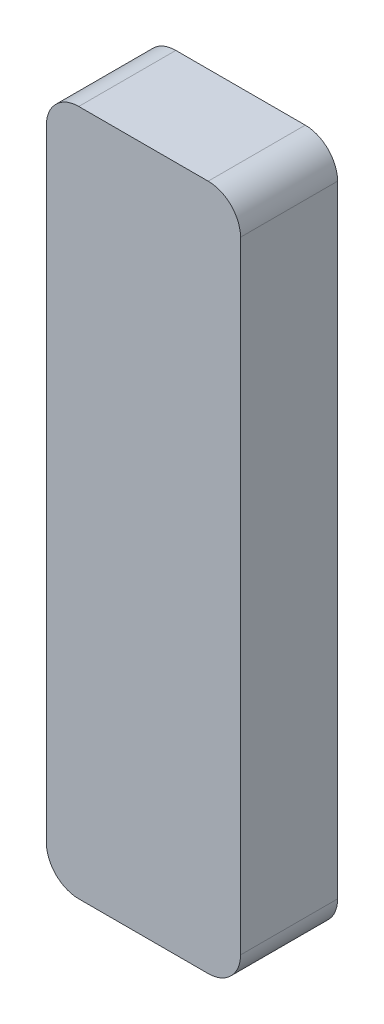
ISO-10303-21;
HEADER;
FILE_DESCRIPTION(('STEP AP214'),'2;1');
FILE_NAME('part.step','',(''),(''),'','','');
FILE_SCHEMA(('AUTOMOTIVE_DESIGN { 1 0 10303 214 1 1 1 1 }'));
ENDSEC;
DATA;
#1=APPLICATION_CONTEXT('core data for automotive mechanical design processes');
#2=APPLICATION_PROTOCOL_DEFINITION('international standard','automotive_design',2000,#1);
#3=PRODUCT_CONTEXT('',#1,'mechanical');
#4=PRODUCT('Part','Part','',(#3));
#5=PRODUCT_RELATED_PRODUCT_CATEGORY('part','',(#4));
#6=PRODUCT_DEFINITION_FORMATION('','',#4);
#7=PRODUCT_DEFINITION_CONTEXT('part definition',#1,'design');
#8=PRODUCT_DEFINITION('design','',#6,#7);
#9=PRODUCT_DEFINITION_SHAPE('','',#8);
#10=(LENGTH_UNIT() NAMED_UNIT(*) SI_UNIT(.MILLI.,.METRE.));
#11=(NAMED_UNIT(*) PLANE_ANGLE_UNIT() SI_UNIT($,.RADIAN.));
#12=(NAMED_UNIT(*) SI_UNIT($,.STERADIAN.) SOLID_ANGLE_UNIT());
#13=UNCERTAINTY_MEASURE_WITH_UNIT(LENGTH_MEASURE(1.E-05),#10,'distance_accuracy_value','');
#14=(GEOMETRIC_REPRESENTATION_CONTEXT(3) GLOBAL_UNCERTAINTY_ASSIGNED_CONTEXT((#13)) GLOBAL_UNIT_ASSIGNED_CONTEXT((#10,
#11,#12)) REPRESENTATION_CONTEXT('',''));
#15=CARTESIAN_POINT('',(0.,0.,0.));
#16=DIRECTION('',(0.,0.,1.));
#17=DIRECTION('',(1.,0.,0.));
#18=AXIS2_PLACEMENT_3D('',#15,#16,#17);
#19=CARTESIAN_POINT('',(-2.,-9.605,3.));
#20=DIRECTION('',(0.,0.,-1.));
#21=DIRECTION('',(-1.,0.,0.));
#22=AXIS2_PLACEMENT_3D('',#19,#20,#21);
#23=CYLINDRICAL_SURFACE('',#22,1.);
#24=CARTESIAN_POINT('',(-2.,-9.605,0.));
#25=DIRECTION('',(0.,0.,1.));
#26=DIRECTION('',(-1.,0.,0.));
#27=AXIS2_PLACEMENT_3D('',#24,#25,#26);
#28=CIRCLE('',#27,1.);
#29=CARTESIAN_POINT('',(-3.,-9.605,0.));
#30=VERTEX_POINT('',#29);
#31=CARTESIAN_POINT('',(-2.,-10.605,0.));
#32=VERTEX_POINT('',#31);
#33=EDGE_CURVE('E131',#30,#32,#28,.T.);
#34=ORIENTED_EDGE('',*,*,#33,.T.);
#35=DIRECTION('',(0.,0.,-1.));
#36=VECTOR('',#35,1.);
#37=CARTESIAN_POINT('',(-2.,-10.605,3.));
#38=LINE('',#37,#36);
#39=CARTESIAN_POINT('',(-2.,-10.605,3.));
#40=VERTEX_POINT('',#39);
#41=EDGE_CURVE('E11',#40,#32,#38,.T.);
#42=ORIENTED_EDGE('',*,*,#41,.F.);
#43=CARTESIAN_POINT('',(-2.,-9.605,3.));
#44=DIRECTION('',(0.,0.,1.));
#45=DIRECTION('',(-1.,0.,0.));
#46=AXIS2_PLACEMENT_3D('',#43,#44,#45);
#47=CIRCLE('',#46,1.);
#48=CARTESIAN_POINT('',(-3.,-9.605,3.));
#49=VERTEX_POINT('',#48);
#50=EDGE_CURVE('E145',#49,#40,#47,.T.);
#51=ORIENTED_EDGE('',*,*,#50,.F.);
#52=DIRECTION('',(0.,0.,-1.));
#53=VECTOR('',#52,1.);
#54=CARTESIAN_POINT('',(-3.,-9.605,3.));
#55=LINE('',#54,#53);
#56=EDGE_CURVE('E127',#49,#30,#55,.T.);
#57=ORIENTED_EDGE('',*,*,#56,.T.);
#58=EDGE_LOOP('',(#34,#42,#51,#57));
#59=FACE_BOUND('',#58,.T.);
#60=ADVANCED_FACE('F35',(#59),#23,.T.);
#61=CARTESIAN_POINT('',(-2.,-10.605,3.));
#62=DIRECTION('',(0.,1.,0.));
#63=DIRECTION('',(0.,0.,1.));
#64=AXIS2_PLACEMENT_3D('',#61,#62,#63);
#65=PLANE('',#64);
#66=DIRECTION('',(1.,0.,0.));
#67=VECTOR('',#66,1.);
#68=CARTESIAN_POINT('',(-2.,-10.605,0.));
#69=LINE('',#68,#67);
#70=CARTESIAN_POINT('',(2.,-10.605,0.));
#71=VERTEX_POINT('',#70);
#72=EDGE_CURVE('E134',#32,#71,#69,.T.);
#73=ORIENTED_EDGE('',*,*,#72,.T.);
#74=DIRECTION('',(0.,0.,-1.));
#75=VECTOR('',#74,1.);
#76=CARTESIAN_POINT('',(2.,-10.605,3.));
#77=LINE('',#76,#75);
#78=CARTESIAN_POINT('',(2.,-10.605,3.));
#79=VERTEX_POINT('',#78);
#80=EDGE_CURVE('E43',#79,#71,#77,.T.);
#81=ORIENTED_EDGE('',*,*,#80,.F.);
#82=DIRECTION('',(1.,0.,0.));
#83=VECTOR('',#82,1.);
#84=CARTESIAN_POINT('',(-2.,-10.605,3.));
#85=LINE('',#84,#83);
#86=EDGE_CURVE('E94',#40,#79,#85,.T.);
#87=ORIENTED_EDGE('',*,*,#86,.F.);
#88=ORIENTED_EDGE('',*,*,#41,.T.);
#89=EDGE_LOOP('',(#73,#81,#87,#88));
#90=FACE_BOUND('',#89,.T.);
#91=ADVANCED_FACE('F180',(#90),#65,.F.);
#92=CARTESIAN_POINT('',(2.,-9.605,3.));
#93=DIRECTION('',(0.,0.,-1.));
#94=DIRECTION('',(-1.,0.,0.));
#95=AXIS2_PLACEMENT_3D('',#92,#93,#94);
#96=CYLINDRICAL_SURFACE('',#95,1.);
#97=CARTESIAN_POINT('',(2.,-9.605,0.));
#98=DIRECTION('',(0.,0.,1.));
#99=DIRECTION('',(1.,0.,0.));
#100=AXIS2_PLACEMENT_3D('',#97,#98,#99);
#101=CIRCLE('',#100,1.);
#102=CARTESIAN_POINT('',(3.,-9.605,0.));
#103=VERTEX_POINT('',#102);
#104=EDGE_CURVE('E136',#71,#103,#101,.T.);
#105=ORIENTED_EDGE('',*,*,#104,.T.);
#106=DIRECTION('',(0.,0.,-1.));
#107=VECTOR('',#106,1.);
#108=CARTESIAN_POINT('',(3.,-9.605,3.));
#109=LINE('',#108,#107);
#110=CARTESIAN_POINT('',(3.,-9.605,3.));
#111=VERTEX_POINT('',#110);
#112=EDGE_CURVE('E152',#111,#103,#109,.T.);
#113=ORIENTED_EDGE('',*,*,#112,.F.);
#114=CARTESIAN_POINT('',(2.,-9.605,3.));
#115=DIRECTION('',(0.,0.,1.));
#116=DIRECTION('',(1.,0.,0.));
#117=AXIS2_PLACEMENT_3D('',#114,#115,#116);
#118=CIRCLE('',#117,1.);
#119=EDGE_CURVE('E160',#79,#111,#118,.T.);
#120=ORIENTED_EDGE('',*,*,#119,.F.);
#121=ORIENTED_EDGE('',*,*,#80,.T.);
#122=EDGE_LOOP('',(#105,#113,#120,#121));
#123=FACE_BOUND('',#122,.T.);
#124=ADVANCED_FACE('F158',(#123),#96,.T.);
#125=CARTESIAN_POINT('',(3.,9.605,3.));
#126=DIRECTION('',(-1.,0.,0.));
#127=DIRECTION('',(0.,0.,1.));
#128=AXIS2_PLACEMENT_3D('',#125,#126,#127);
#129=PLANE('',#128);
#130=DIRECTION('',(0.,1.,0.));
#131=VECTOR('',#130,1.);
#132=CARTESIAN_POINT('',(3.,9.605,0.));
#133=LINE('',#132,#131);
#134=CARTESIAN_POINT('',(3.,9.605,0.));
#135=VERTEX_POINT('',#134);
#136=EDGE_CURVE('E138',#103,#135,#133,.T.);
#137=ORIENTED_EDGE('',*,*,#136,.T.);
#138=DIRECTION('',(0.,0.,-1.));
#139=VECTOR('',#138,1.);
#140=CARTESIAN_POINT('',(3.,9.605,3.));
#141=LINE('',#140,#139);
#142=CARTESIAN_POINT('',(3.,9.605,3.));
#143=VERTEX_POINT('',#142);
#144=EDGE_CURVE('E149',#143,#135,#141,.T.);
#145=ORIENTED_EDGE('',*,*,#144,.F.);
#146=DIRECTION('',(0.,1.,0.));
#147=VECTOR('',#146,1.);
#148=CARTESIAN_POINT('',(3.,9.605,3.));
#149=LINE('',#148,#147);
#150=EDGE_CURVE('E172',#111,#143,#149,.T.);
#151=ORIENTED_EDGE('',*,*,#150,.F.);
#152=ORIENTED_EDGE('',*,*,#112,.T.);
#153=EDGE_LOOP('',(#137,#145,#151,#152));
#154=FACE_BOUND('',#153,.T.);
#155=ADVANCED_FACE('F168',(#154),#129,.F.);
#156=CARTESIAN_POINT('',(2.,9.605,3.));
#157=DIRECTION('',(0.,0.,-1.));
#158=DIRECTION('',(-1.,0.,0.));
#159=AXIS2_PLACEMENT_3D('',#156,#157,#158);
#160=CYLINDRICAL_SURFACE('',#159,1.);
#161=CARTESIAN_POINT('',(2.,9.605,0.));
#162=DIRECTION('',(0.,0.,1.));
#163=DIRECTION('',(1.,0.,0.));
#164=AXIS2_PLACEMENT_3D('',#161,#162,#163);
#165=CIRCLE('',#164,1.);
#166=CARTESIAN_POINT('',(2.,10.605,0.));
#167=VERTEX_POINT('',#166);
#168=EDGE_CURVE('E140',#135,#167,#165,.T.);
#169=ORIENTED_EDGE('',*,*,#168,.T.);
#170=DIRECTION('',(0.,0.,-1.));
#171=VECTOR('',#170,1.);
#172=CARTESIAN_POINT('',(2.,10.605,3.));
#173=LINE('',#172,#171);
#174=CARTESIAN_POINT('',(2.,10.605,3.));
#175=VERTEX_POINT('',#174);
#176=EDGE_CURVE('E122',#175,#167,#173,.T.);
#177=ORIENTED_EDGE('',*,*,#176,.F.);
#178=CARTESIAN_POINT('',(2.,9.605,3.));
#179=DIRECTION('',(0.,0.,1.));
#180=DIRECTION('',(1.,0.,0.));
#181=AXIS2_PLACEMENT_3D('',#178,#179,#180);
#182=CIRCLE('',#181,1.);
#183=EDGE_CURVE('E113',#143,#175,#182,.T.);
#184=ORIENTED_EDGE('',*,*,#183,.F.);
#185=ORIENTED_EDGE('',*,*,#144,.T.);
#186=EDGE_LOOP('',(#169,#177,#184,#185));
#187=FACE_BOUND('',#186,.T.);
#188=ADVANCED_FACE('F171',(#187),#160,.T.);
#189=CARTESIAN_POINT('',(-2.,10.605,3.));
#190=DIRECTION('',(0.,-1.,0.));
#191=DIRECTION('',(0.,0.,-1.));
#192=AXIS2_PLACEMENT_3D('',#189,#190,#191);
#193=PLANE('',#192);
#194=DIRECTION('',(-1.,0.,0.));
#195=VECTOR('',#194,1.);
#196=CARTESIAN_POINT('',(-2.,10.605,0.));
#197=LINE('',#196,#195);
#198=CARTESIAN_POINT('',(-2.,10.605,0.));
#199=VERTEX_POINT('',#198);
#200=EDGE_CURVE('E121',#167,#199,#197,.T.);
#201=ORIENTED_EDGE('',*,*,#200,.T.);
#202=DIRECTION('',(0.,0.,-1.));
#203=VECTOR('',#202,1.);
#204=CARTESIAN_POINT('',(-2.,10.605,3.));
#205=LINE('',#204,#203);
#206=CARTESIAN_POINT('',(-2.,10.605,3.));
#207=VERTEX_POINT('',#206);
#208=EDGE_CURVE('E118',#207,#199,#205,.T.);
#209=ORIENTED_EDGE('',*,*,#208,.F.);
#210=DIRECTION('',(-1.,0.,0.));
#211=VECTOR('',#210,1.);
#212=CARTESIAN_POINT('',(-2.,10.605,3.));
#213=LINE('',#212,#211);
#214=EDGE_CURVE('E107',#175,#207,#213,.T.);
#215=ORIENTED_EDGE('',*,*,#214,.F.);
#216=ORIENTED_EDGE('',*,*,#176,.T.);
#217=EDGE_LOOP('',(#201,#209,#215,#216));
#218=FACE_BOUND('',#217,.T.);
#219=ADVANCED_FACE('F119',(#218),#193,.F.);
#220=CARTESIAN_POINT('',(-2.,9.605,3.));
#221=DIRECTION('',(0.,0.,-1.));
#222=DIRECTION('',(-1.,0.,0.));
#223=AXIS2_PLACEMENT_3D('',#220,#221,#222);
#224=CYLINDRICAL_SURFACE('',#223,1.);
#225=CARTESIAN_POINT('',(-2.,9.605,0.));
#226=DIRECTION('',(0.,0.,1.));
#227=DIRECTION('',(1.,0.,0.));
#228=AXIS2_PLACEMENT_3D('',#225,#226,#227);
#229=CIRCLE('',#228,1.);
#230=CARTESIAN_POINT('',(-3.,9.605,0.));
#231=VERTEX_POINT('',#230);
#232=EDGE_CURVE('E80',#199,#231,#229,.T.);
#233=ORIENTED_EDGE('',*,*,#232,.T.);
#234=DIRECTION('',(0.,0.,-1.));
#235=VECTOR('',#234,1.);
#236=CARTESIAN_POINT('',(-3.,9.605,3.));
#237=LINE('',#236,#235);
#238=CARTESIAN_POINT('',(-3.,9.605,3.));
#239=VERTEX_POINT('',#238);
#240=EDGE_CURVE('E123',#239,#231,#237,.T.);
#241=ORIENTED_EDGE('',*,*,#240,.F.);
#242=CARTESIAN_POINT('',(-2.,9.605,3.));
#243=DIRECTION('',(0.,0.,1.));
#244=DIRECTION('',(1.,0.,0.));
#245=AXIS2_PLACEMENT_3D('',#242,#243,#244);
#246=CIRCLE('',#245,1.);
#247=EDGE_CURVE('E111',#207,#239,#246,.T.);
#248=ORIENTED_EDGE('',*,*,#247,.F.);
#249=ORIENTED_EDGE('',*,*,#208,.T.);
#250=EDGE_LOOP('',(#233,#241,#248,#249));
#251=FACE_BOUND('',#250,.T.);
#252=ADVANCED_FACE('F125',(#251),#224,.T.);
#253=CARTESIAN_POINT('',(-3.,9.605,3.));
#254=DIRECTION('',(1.,0.,0.));
#255=DIRECTION('',(0.,0.,-1.));
#256=AXIS2_PLACEMENT_3D('',#253,#254,#255);
#257=PLANE('',#256);
#258=DIRECTION('',(0.,-1.,0.));
#259=VECTOR('',#258,1.);
#260=CARTESIAN_POINT('',(-3.,9.605,0.));
#261=LINE('',#260,#259);
#262=EDGE_CURVE('E86',#231,#30,#261,.T.);
#263=ORIENTED_EDGE('',*,*,#262,.T.);
#264=ORIENTED_EDGE('',*,*,#56,.F.);
#265=DIRECTION('',(0.,-1.,0.));
#266=VECTOR('',#265,1.);
#267=CARTESIAN_POINT('',(-3.,9.605,3.));
#268=LINE('',#267,#266);
#269=EDGE_CURVE('E51',#239,#49,#268,.T.);
#270=ORIENTED_EDGE('',*,*,#269,.F.);
#271=ORIENTED_EDGE('',*,*,#240,.T.);
#272=EDGE_LOOP('',(#263,#264,#270,#271));
#273=FACE_BOUND('',#272,.T.);
#274=ADVANCED_FACE('F196',(#273),#257,.F.);
#275=CARTESIAN_POINT('',(-2.,-9.605,3.));
#276=DIRECTION('',(0.,0.,-1.));
#277=DIRECTION('',(-1.,0.,0.));
#278=AXIS2_PLACEMENT_3D('',#275,#276,#277);
#279=PLANE('',#278);
#280=ORIENTED_EDGE('',*,*,#50,.T.);
#281=ORIENTED_EDGE('',*,*,#86,.T.);
#282=ORIENTED_EDGE('',*,*,#119,.T.);
#283=ORIENTED_EDGE('',*,*,#150,.T.);
#284=ORIENTED_EDGE('',*,*,#183,.T.);
#285=ORIENTED_EDGE('',*,*,#214,.T.);
#286=ORIENTED_EDGE('',*,*,#247,.T.);
#287=ORIENTED_EDGE('',*,*,#269,.T.);
#288=EDGE_LOOP('',(#280,#281,#282,#283,#284,#285,#286,#287));
#289=FACE_BOUND('',#288,.T.);
#290=ADVANCED_FACE('F109',(#289),#279,.F.);
#291=CARTESIAN_POINT('',(-2.,-9.605,0.));
#292=DIRECTION('',(0.,0.,-1.));
#293=DIRECTION('',(-1.,0.,0.));
#294=AXIS2_PLACEMENT_3D('',#291,#292,#293);
#295=PLANE('',#294);
#296=ORIENTED_EDGE('',*,*,#33,.F.);
#297=ORIENTED_EDGE('',*,*,#262,.F.);
#298=ORIENTED_EDGE('',*,*,#232,.F.);
#299=ORIENTED_EDGE('',*,*,#200,.F.);
#300=ORIENTED_EDGE('',*,*,#168,.F.);
#301=ORIENTED_EDGE('',*,*,#136,.F.);
#302=ORIENTED_EDGE('',*,*,#104,.F.);
#303=ORIENTED_EDGE('',*,*,#72,.F.);
#304=EDGE_LOOP('',(#296,#297,#298,#299,#300,#301,#302,#303));
#305=FACE_BOUND('',#304,.T.);
#306=ADVANCED_FACE('F164',(#305),#295,.T.);
#307=CLOSED_SHELL('',(#60,#91,#124,#155,#188,#219,#252,#274,#290,#306));
#308=MANIFOLD_SOLID_BREP('B2',#307);
#309=ADVANCED_BREP_SHAPE_REPRESENTATION('',(#18,#308),#14);
#310=SHAPE_DEFINITION_REPRESENTATION(#9,#309);
ENDSEC;
END-ISO-10303-21;
